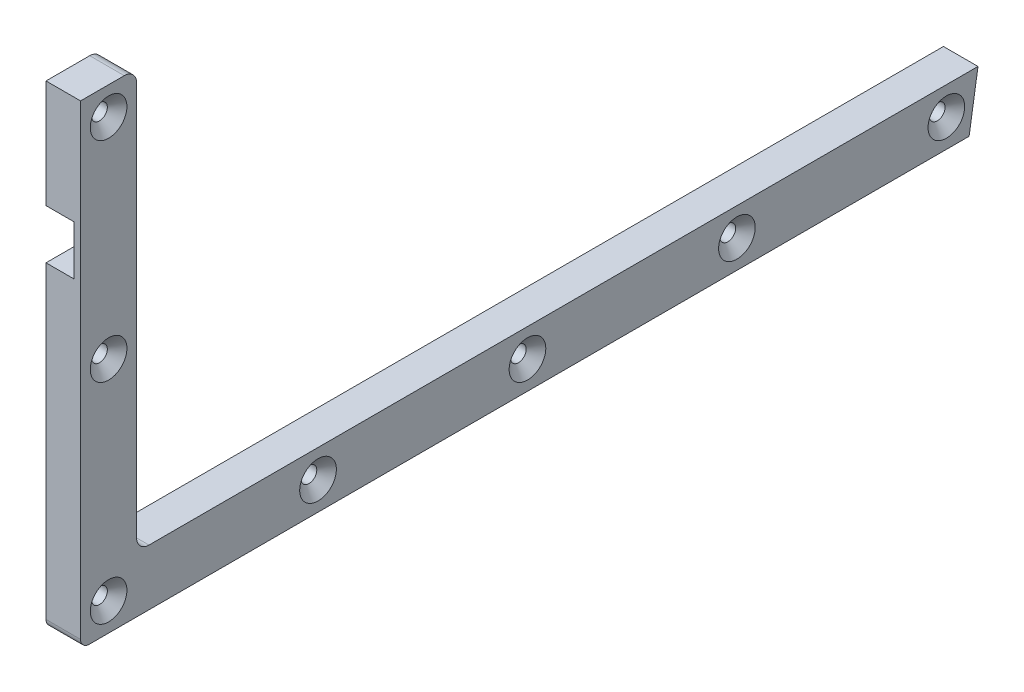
from build123d import *

# Parameters (mm, degrees)
SKETCH1_R           = 1.905
BOSS_EXTRUDE1_DEPTH = 8.382
CHAMFER1_SIZE       = 2.54
CHAMFER1_SIZE2      = 2.207988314
SKETCH2_W           = 18.8
SKETCH2_H           = 12
CUT_EXTRUDE1_DEPTH  = 6.782


with BuildPart() as part:
    # Sketch1 → Boss-Extrude1 (new body)
    with BuildSketch(Plane(origin=(0, 0, 0), x_dir=(0, 0, -1), z_dir=(1, 0, 0))):
        with BuildLine():
            Line((-7.519038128, 58.745589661), (-7.519038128, -54.37074257))
            ThreePointArc((-7.519038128, -54.37074257), (-6.908745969, -55.844118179), (-5.43537036, -56.454410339))
            Line((-5.43537036, -56.454410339), (207.999961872, -56.454410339))
            Line((207.999961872, -56.454410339), (210.155038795, -42.854410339))
            Line((210.155038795, -42.854410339), (9.080961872, -42.854410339))
            ThreePointArc((9.080961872, -42.854410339), (6.959641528, -41.975730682), (6.080961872, -39.854410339))
            Line((6.080961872, -39.854410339), (6.080961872, 55.745589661))
            ThreePointArc((6.080961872, 55.745589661), (5.202282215, 57.866910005), (3.080961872, 58.745589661))
            Line((3.080961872, 58.745589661), (-7.519038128, 58.745589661))
        make_face()
        with Locations((100.880961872, -49.654410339)):
            Circle(SKETCH1_R, mode=Mode.SUBTRACT)
        with Locations((151.680961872, -49.654410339)):
            Circle(SKETCH1_R, mode=Mode.SUBTRACT)
        with Locations((50.080961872, -49.654410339)):
            Circle(SKETCH1_R, mode=Mode.SUBTRACT)
        with Locations((-0.719038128, -49.654410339)):
            Circle(SKETCH1_R, mode=Mode.SUBTRACT)
        with Locations((-0.719038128, 1.145589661)):
            Circle(SKETCH1_R, mode=Mode.SUBTRACT)
        with Locations((-0.719038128, 51.945589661)):
            Circle(SKETCH1_R, mode=Mode.SUBTRACT)
        with Locations((202.480961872, -49.654410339)):
            Circle(SKETCH1_R, mode=Mode.SUBTRACT)
    extrude(amount=BOSS_EXTRUDE1_DEPTH)

    # Chamfer1
    chamfer1_edges = [part.edges().sort_by_distance(p)[0] for p in [
        (8.382, -49.654410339, -149.775961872),
        (8.382, -49.654410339, -48.175961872),
        (8.382, -49.654410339, -200.575961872),
        (8.382, -49.654410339, -98.975961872),
        (8.382, -49.654410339, 2.624038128),
        (8.382, 1.145589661, 2.624038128),
        (8.382, 51.945589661, 2.624038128),
    ]]
    chamfer1_side = [part.faces().sort_by_distance(p)[0] for p in [
        (8.382, 2.187423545, 5.056254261),
    ]]
    chamfer(chamfer1_edges, length=CHAMFER1_SIZE, length2=CHAMFER1_SIZE2, reference=chamfer1_side[0])

    # Sketch2 → Cut-Extrude1 (cut)
    with BuildSketch(Plane.ZY):
        with Locations((-1.880961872, 26.545589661)):
            Rectangle(SKETCH2_W, SKETCH2_H)
    extrude(amount=-CUT_EXTRUDE1_DEPTH, mode=Mode.SUBTRACT)


solid = part.part
